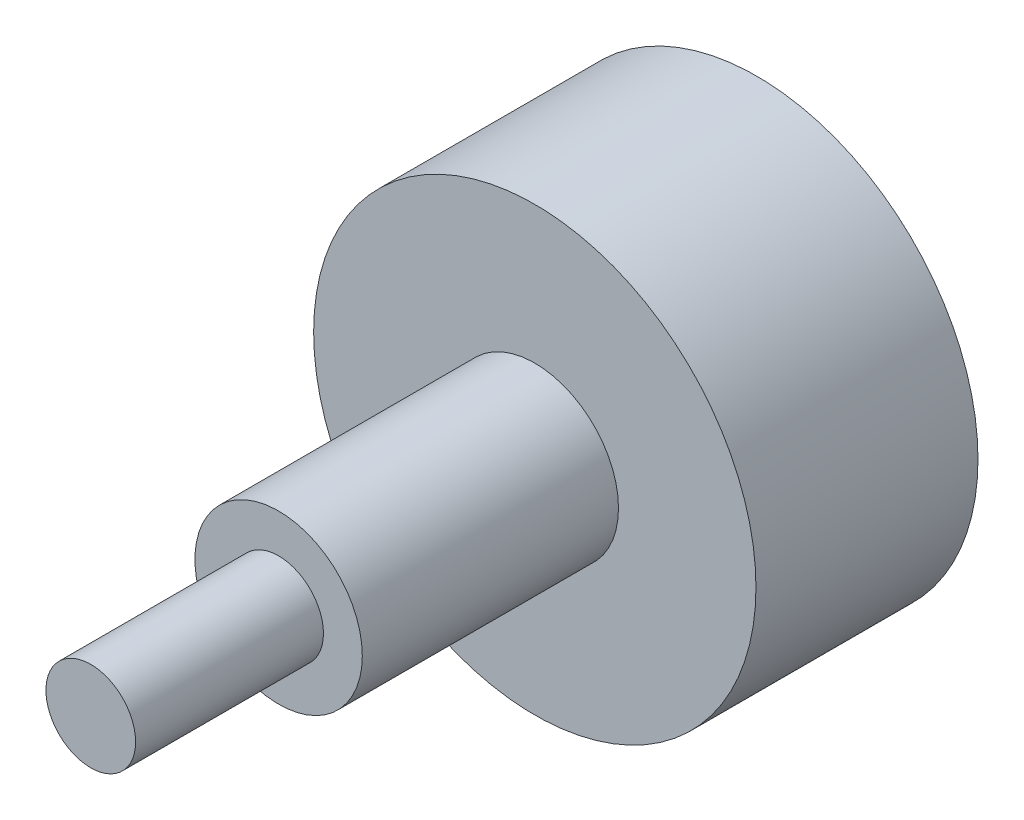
ISO-10303-21;
HEADER;
FILE_DESCRIPTION(('STEP AP214'),'2;1');
FILE_NAME('part.step','',(''),(''),'','','');
FILE_SCHEMA(('AUTOMOTIVE_DESIGN { 1 0 10303 214 1 1 1 1 }'));
ENDSEC;
DATA;
#1=APPLICATION_CONTEXT('core data for automotive mechanical design processes');
#2=APPLICATION_PROTOCOL_DEFINITION('international standard','automotive_design',2000,#1);
#3=PRODUCT_CONTEXT('',#1,'mechanical');
#4=PRODUCT('Part','Part','',(#3));
#5=PRODUCT_RELATED_PRODUCT_CATEGORY('part','',(#4));
#6=PRODUCT_DEFINITION_FORMATION('','',#4);
#7=PRODUCT_DEFINITION_CONTEXT('part definition',#1,'design');
#8=PRODUCT_DEFINITION('design','',#6,#7);
#9=PRODUCT_DEFINITION_SHAPE('','',#8);
#10=(LENGTH_UNIT() NAMED_UNIT(*) SI_UNIT(.MILLI.,.METRE.));
#11=(NAMED_UNIT(*) PLANE_ANGLE_UNIT() SI_UNIT($,.RADIAN.));
#12=(NAMED_UNIT(*) SI_UNIT($,.STERADIAN.) SOLID_ANGLE_UNIT());
#13=UNCERTAINTY_MEASURE_WITH_UNIT(LENGTH_MEASURE(1.E-05),#10,'distance_accuracy_value','');
#14=(GEOMETRIC_REPRESENTATION_CONTEXT(3) GLOBAL_UNCERTAINTY_ASSIGNED_CONTEXT((#13)) GLOBAL_UNIT_ASSIGNED_CONTEXT((#10,
#11,#12)) REPRESENTATION_CONTEXT('',''));
#15=CARTESIAN_POINT('',(0.,0.,0.));
#16=DIRECTION('',(0.,0.,1.));
#17=DIRECTION('',(1.,0.,0.));
#18=AXIS2_PLACEMENT_3D('',#15,#16,#17);
#19=CARTESIAN_POINT('',(0.,0.,13.));
#20=DIRECTION('',(0.,0.,1.));
#21=DIRECTION('',(1.,0.,0.));
#22=AXIS2_PLACEMENT_3D('',#19,#20,#21);
#23=PLANE('',#22);
#24=CARTESIAN_POINT('',(0.,0.,13.));
#25=DIRECTION('',(0.,0.,1.));
#26=DIRECTION('',(1.,0.,0.));
#27=AXIS2_PLACEMENT_3D('',#24,#25,#26);
#28=CIRCLE('',#27,4.9);
#29=CARTESIAN_POINT('',(4.9,0.,13.));
#30=VERTEX_POINT('',#29);
#31=EDGE_CURVE('E52',#30,#30,#28,.T.);
#32=ORIENTED_EDGE('',*,*,#31,.F.);
#33=EDGE_LOOP('',(#32));
#34=FACE_BOUND('',#33,.T.);
#35=CARTESIAN_POINT('',(0.,0.,13.));
#36=DIRECTION('',(0.,0.,1.));
#37=DIRECTION('',(1.,0.,0.));
#38=AXIS2_PLACEMENT_3D('',#35,#36,#37);
#39=CIRCLE('',#38,12.95);
#40=CARTESIAN_POINT('',(12.95,0.,13.));
#41=VERTEX_POINT('',#40);
#42=EDGE_CURVE('E56',#41,#41,#39,.T.);
#43=ORIENTED_EDGE('',*,*,#42,.T.);
#44=EDGE_LOOP('',(#43));
#45=FACE_BOUND('',#44,.T.);
#46=ADVANCED_FACE('F37',(#34,#45),#23,.T.);
#47=CARTESIAN_POINT('',(0.,0.,28.));
#48=DIRECTION('',(0.,0.,-1.));
#49=DIRECTION('',(-1.,0.,0.));
#50=AXIS2_PLACEMENT_3D('',#47,#48,#49);
#51=CYLINDRICAL_SURFACE('',#50,4.9);
#52=CARTESIAN_POINT('',(0.,0.,28.));
#53=DIRECTION('',(0.,0.,1.));
#54=DIRECTION('',(1.,0.,0.));
#55=AXIS2_PLACEMENT_3D('',#52,#53,#54);
#56=CIRCLE('',#55,4.9);
#57=CARTESIAN_POINT('',(4.9,0.,28.));
#58=VERTEX_POINT('',#57);
#59=EDGE_CURVE('E48',#58,#58,#56,.T.);
#60=ORIENTED_EDGE('',*,*,#59,.F.);
#61=EDGE_LOOP('',(#60));
#62=FACE_BOUND('',#61,.T.);
#63=ORIENTED_EDGE('',*,*,#31,.T.);
#64=EDGE_LOOP('',(#63));
#65=FACE_BOUND('',#64,.T.);
#66=ADVANCED_FACE('F81',(#62,#65),#51,.T.);
#67=CARTESIAN_POINT('',(0.,0.,28.));
#68=DIRECTION('',(0.,0.,1.));
#69=DIRECTION('',(1.,0.,0.));
#70=AXIS2_PLACEMENT_3D('',#67,#68,#69);
#71=PLANE('',#70);
#72=CARTESIAN_POINT('',(0.,0.,28.));
#73=DIRECTION('',(0.,0.,1.));
#74=DIRECTION('',(1.,0.,0.));
#75=AXIS2_PLACEMENT_3D('',#72,#73,#74);
#76=CIRCLE('',#75,2.625);
#77=CARTESIAN_POINT('',(2.625,0.,28.));
#78=VERTEX_POINT('',#77);
#79=EDGE_CURVE('E10',#78,#78,#76,.F.);
#80=ORIENTED_EDGE('',*,*,#79,.T.);
#81=EDGE_LOOP('',(#80));
#82=FACE_BOUND('',#81,.T.);
#83=ORIENTED_EDGE('',*,*,#59,.T.);
#84=EDGE_LOOP('',(#83));
#85=FACE_BOUND('',#84,.T.);
#86=ADVANCED_FACE('F87',(#82,#85),#71,.T.);
#87=CARTESIAN_POINT('',(0.,0.,39.));
#88=DIRECTION('',(0.,0.,1.));
#89=DIRECTION('',(1.,0.,0.));
#90=AXIS2_PLACEMENT_3D('',#87,#88,#89);
#91=PLANE('',#90);
#92=CARTESIAN_POINT('',(0.,0.,39.));
#93=DIRECTION('',(0.,0.,1.));
#94=DIRECTION('',(1.,0.,0.));
#95=AXIS2_PLACEMENT_3D('',#92,#93,#94);
#96=CIRCLE('',#95,2.625);
#97=CARTESIAN_POINT('',(2.625,0.,39.));
#98=VERTEX_POINT('',#97);
#99=EDGE_CURVE('E44',#98,#98,#96,.T.);
#100=ORIENTED_EDGE('',*,*,#99,.T.);
#101=EDGE_LOOP('',(#100));
#102=FACE_BOUND('',#101,.T.);
#103=ADVANCED_FACE('F75',(#102),#91,.T.);
#104=CARTESIAN_POINT('',(0.,0.,5.57537879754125));
#105=DIRECTION('',(0.,0.,1.));
#106=DIRECTION('',(1.,0.,0.));
#107=AXIS2_PLACEMENT_3D('',#104,#105,#106);
#108=CYLINDRICAL_SURFACE('',#107,2.625);
#109=ORIENTED_EDGE('',*,*,#79,.F.);
#110=EDGE_LOOP('',(#109));
#111=FACE_BOUND('',#110,.T.);
#112=ORIENTED_EDGE('',*,*,#99,.F.);
#113=EDGE_LOOP('',(#112));
#114=FACE_BOUND('',#113,.T.);
#115=ADVANCED_FACE('F67',(#111,#114),#108,.T.);
#116=CARTESIAN_POINT('',(0.,0.,39.));
#117=DIRECTION('',(0.,0.,-1.));
#118=DIRECTION('',(-1.,0.,0.));
#119=AXIS2_PLACEMENT_3D('',#116,#117,#118);
#120=CYLINDRICAL_SURFACE('',#119,12.95);
#121=ORIENTED_EDGE('',*,*,#42,.F.);
#122=EDGE_LOOP('',(#121));
#123=FACE_BOUND('',#122,.T.);
#124=CARTESIAN_POINT('',(0.,0.,0.));
#125=DIRECTION('',(0.,0.,-1.));
#126=DIRECTION('',(-1.,0.,0.));
#127=AXIS2_PLACEMENT_3D('',#124,#125,#126);
#128=CIRCLE('',#127,12.95);
#129=CARTESIAN_POINT('',(-12.95,0.,0.));
#130=VERTEX_POINT('',#129);
#131=EDGE_CURVE('E60',#130,#130,#128,.T.);
#132=ORIENTED_EDGE('',*,*,#131,.F.);
#133=EDGE_LOOP('',(#132));
#134=FACE_BOUND('',#133,.T.);
#135=ADVANCED_FACE('F65',(#123,#134),#120,.T.);
#136=CARTESIAN_POINT('',(0.,0.,0.));
#137=DIRECTION('',(0.,0.,1.));
#138=DIRECTION('',(1.,0.,0.));
#139=AXIS2_PLACEMENT_3D('',#136,#137,#138);
#140=PLANE('',#139);
#141=ORIENTED_EDGE('',*,*,#131,.T.);
#142=EDGE_LOOP('',(#141));
#143=FACE_BOUND('',#142,.T.);
#144=ADVANCED_FACE('F39',(#143),#140,.F.);
#145=CLOSED_SHELL('',(#46,#66,#86,#103,#115,#135,#144));
#146=MANIFOLD_SOLID_BREP('B2',#145);
#147=ADVANCED_BREP_SHAPE_REPRESENTATION('',(#18,#146),#14);
#148=SHAPE_DEFINITION_REPRESENTATION(#9,#147);
ENDSEC;
END-ISO-10303-21;
